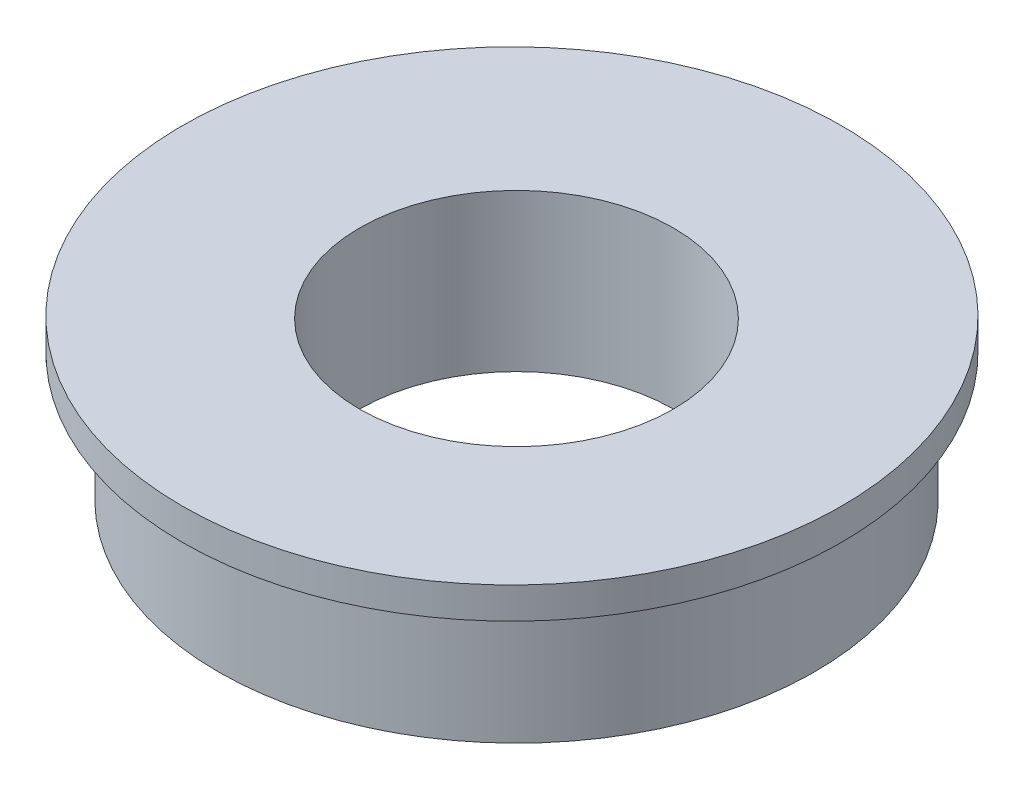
ISO-10303-21;
HEADER;
FILE_DESCRIPTION(('STEP AP214'),'2;1');
FILE_NAME('part.step','',(''),(''),'','','');
FILE_SCHEMA(('AUTOMOTIVE_DESIGN { 1 0 10303 214 1 1 1 1 }'));
ENDSEC;
DATA;
#1=APPLICATION_CONTEXT('core data for automotive mechanical design processes');
#2=APPLICATION_PROTOCOL_DEFINITION('international standard','automotive_design',2000,#1);
#3=PRODUCT_CONTEXT('',#1,'mechanical');
#4=PRODUCT('Part','Part','',(#3));
#5=PRODUCT_RELATED_PRODUCT_CATEGORY('part','',(#4));
#6=PRODUCT_DEFINITION_FORMATION('','',#4);
#7=PRODUCT_DEFINITION_CONTEXT('part definition',#1,'design');
#8=PRODUCT_DEFINITION('design','',#6,#7);
#9=PRODUCT_DEFINITION_SHAPE('','',#8);
#10=(LENGTH_UNIT() NAMED_UNIT(*) SI_UNIT(.MILLI.,.METRE.));
#11=(NAMED_UNIT(*) PLANE_ANGLE_UNIT() SI_UNIT($,.RADIAN.));
#12=(NAMED_UNIT(*) SI_UNIT($,.STERADIAN.) SOLID_ANGLE_UNIT());
#13=UNCERTAINTY_MEASURE_WITH_UNIT(LENGTH_MEASURE(1.E-05),#10,'distance_accuracy_value','');
#14=(GEOMETRIC_REPRESENTATION_CONTEXT(3) GLOBAL_UNCERTAINTY_ASSIGNED_CONTEXT((#13)) GLOBAL_UNIT_ASSIGNED_CONTEXT((#10,
#11,#12)) REPRESENTATION_CONTEXT('',''));
#15=CARTESIAN_POINT('',(0.,0.,0.));
#16=DIRECTION('',(0.,0.,1.));
#17=DIRECTION('',(1.,0.,0.));
#18=AXIS2_PLACEMENT_3D('',#15,#16,#17);
#19=CARTESIAN_POINT('',(0.,5.,0.));
#20=DIRECTION('',(0.,-1.,0.));
#21=DIRECTION('',(0.,0.,-1.));
#22=AXIS2_PLACEMENT_3D('',#19,#20,#21);
#23=CYLINDRICAL_SURFACE('',#22,9.5);
#24=CARTESIAN_POINT('',(0.,0.,0.));
#25=DIRECTION('',(0.,1.,0.));
#26=DIRECTION('',(0.,0.,1.));
#27=AXIS2_PLACEMENT_3D('',#24,#25,#26);
#28=CIRCLE('',#27,9.5);
#29=CARTESIAN_POINT('',(0.,0.,9.5));
#30=VERTEX_POINT('',#29);
#31=EDGE_CURVE('E44',#30,#30,#28,.T.);
#32=ORIENTED_EDGE('',*,*,#31,.T.);
#33=EDGE_LOOP('',(#32));
#34=FACE_BOUND('',#33,.T.);
#35=CARTESIAN_POINT('',(0.,4.,0.));
#36=DIRECTION('',(0.,1.,0.));
#37=DIRECTION('',(0.,0.,1.));
#38=AXIS2_PLACEMENT_3D('',#35,#36,#37);
#39=CIRCLE('',#38,9.5);
#40=CARTESIAN_POINT('',(0.,4.,9.5));
#41=VERTEX_POINT('',#40);
#42=EDGE_CURVE('E10',#41,#41,#39,.T.);
#43=ORIENTED_EDGE('',*,*,#42,.F.);
#44=EDGE_LOOP('',(#43));
#45=FACE_BOUND('',#44,.T.);
#46=ADVANCED_FACE('F41',(#34,#45),#23,.T.);
#47=CARTESIAN_POINT('',(0.,5.,0.));
#48=DIRECTION('',(0.,1.,0.));
#49=DIRECTION('',(0.,0.,1.));
#50=AXIS2_PLACEMENT_3D('',#47,#48,#49);
#51=PLANE('',#50);
#52=CARTESIAN_POINT('',(0.,5.,0.));
#53=DIRECTION('',(0.,1.,0.));
#54=DIRECTION('',(0.,0.,1.));
#55=AXIS2_PLACEMENT_3D('',#52,#53,#54);
#56=CIRCLE('',#55,5.);
#57=CARTESIAN_POINT('',(0.,5.,5.));
#58=VERTEX_POINT('',#57);
#59=EDGE_CURVE('E54',#58,#58,#56,.T.);
#60=ORIENTED_EDGE('',*,*,#59,.F.);
#61=EDGE_LOOP('',(#60));
#62=FACE_BOUND('',#61,.T.);
#63=CARTESIAN_POINT('',(-0.145329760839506,5.,0.));
#64=DIRECTION('',(0.,1.,0.));
#65=DIRECTION('',(0.,0.,1.));
#66=AXIS2_PLACEMENT_3D('',#63,#64,#65);
#67=CIRCLE('',#66,10.5);
#68=CARTESIAN_POINT('',(-0.145329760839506,5.,10.5));
#69=VERTEX_POINT('',#68);
#70=EDGE_CURVE('E57',#69,#69,#67,.T.);
#71=ORIENTED_EDGE('',*,*,#70,.T.);
#72=EDGE_LOOP('',(#71));
#73=FACE_BOUND('',#72,.T.);
#74=ADVANCED_FACE('F75',(#62,#73),#51,.T.);
#75=CARTESIAN_POINT('',(0.,0.,0.));
#76=DIRECTION('',(0.,1.,0.));
#77=DIRECTION('',(0.,0.,1.));
#78=AXIS2_PLACEMENT_3D('',#75,#76,#77);
#79=PLANE('',#78);
#80=ORIENTED_EDGE('',*,*,#31,.F.);
#81=EDGE_LOOP('',(#80));
#82=FACE_BOUND('',#81,.T.);
#83=CARTESIAN_POINT('',(0.,0.,0.));
#84=DIRECTION('',(0.,1.,0.));
#85=DIRECTION('',(0.,0.,1.));
#86=AXIS2_PLACEMENT_3D('',#83,#84,#85);
#87=CIRCLE('',#86,5.);
#88=CARTESIAN_POINT('',(0.,0.,5.));
#89=VERTEX_POINT('',#88);
#90=EDGE_CURVE('E61',#89,#89,#87,.T.);
#91=ORIENTED_EDGE('',*,*,#90,.T.);
#92=EDGE_LOOP('',(#91));
#93=FACE_BOUND('',#92,.T.);
#94=ADVANCED_FACE('F93',(#82,#93),#79,.F.);
#95=CARTESIAN_POINT('',(0.,5.,0.));
#96=DIRECTION('',(0.,-1.,0.));
#97=DIRECTION('',(0.,0.,-1.));
#98=AXIS2_PLACEMENT_3D('',#95,#96,#97);
#99=CYLINDRICAL_SURFACE('',#98,5.);
#100=ORIENTED_EDGE('',*,*,#59,.T.);
#101=EDGE_LOOP('',(#100));
#102=FACE_BOUND('',#101,.T.);
#103=ORIENTED_EDGE('',*,*,#90,.F.);
#104=EDGE_LOOP('',(#103));
#105=FACE_BOUND('',#104,.T.);
#106=ADVANCED_FACE('F84',(#102,#105),#99,.F.);
#107=CARTESIAN_POINT('',(-0.145329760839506,4.,0.));
#108=DIRECTION('',(0.,1.,0.));
#109=DIRECTION('',(0.,0.,1.));
#110=AXIS2_PLACEMENT_3D('',#107,#108,#109);
#111=PLANE('',#110);
#112=CARTESIAN_POINT('',(-0.145329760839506,4.,0.));
#113=DIRECTION('',(0.,1.,0.));
#114=DIRECTION('',(0.,0.,1.));
#115=AXIS2_PLACEMENT_3D('',#112,#113,#114);
#116=CIRCLE('',#115,10.5);
#117=CARTESIAN_POINT('',(-0.145329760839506,4.,10.5));
#118=VERTEX_POINT('',#117);
#119=EDGE_CURVE('E64',#118,#118,#116,.T.);
#120=ORIENTED_EDGE('',*,*,#119,.F.);
#121=EDGE_LOOP('',(#120));
#122=FACE_BOUND('',#121,.T.);
#123=ORIENTED_EDGE('',*,*,#42,.T.);
#124=EDGE_LOOP('',(#123));
#125=FACE_BOUND('',#124,.T.);
#126=ADVANCED_FACE('F79',(#122,#125),#111,.F.);
#127=CARTESIAN_POINT('',(-0.145329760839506,4.,0.));
#128=DIRECTION('',(0.,1.,0.));
#129=DIRECTION('',(0.,0.,1.));
#130=AXIS2_PLACEMENT_3D('',#127,#128,#129);
#131=CYLINDRICAL_SURFACE('',#130,10.5);
#132=ORIENTED_EDGE('',*,*,#119,.T.);
#133=EDGE_LOOP('',(#132));
#134=FACE_BOUND('',#133,.T.);
#135=ORIENTED_EDGE('',*,*,#70,.F.);
#136=EDGE_LOOP('',(#135));
#137=FACE_BOUND('',#136,.T.);
#138=ADVANCED_FACE('F77',(#134,#137),#131,.T.);
#139=CLOSED_SHELL('',(#46,#74,#94,#106,#126,#138));
#140=MANIFOLD_SOLID_BREP('B2',#139);
#141=ADVANCED_BREP_SHAPE_REPRESENTATION('',(#18,#140),#14);
#142=SHAPE_DEFINITION_REPRESENTATION(#9,#141);
ENDSEC;
END-ISO-10303-21;
